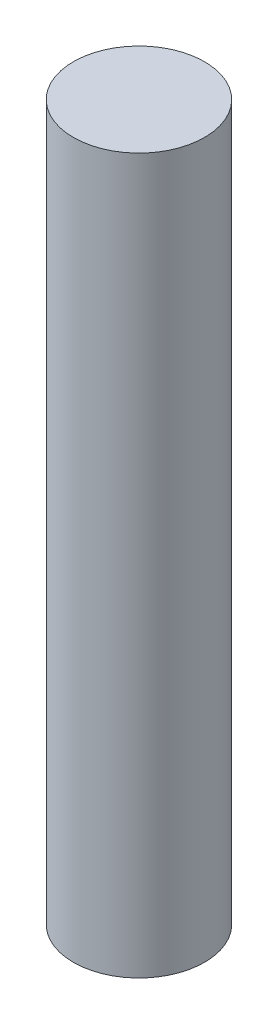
from build123d import *

# Parameters (mm, degrees)
SKETCH1_R           = 2.25
BOSS_EXTRUDE1_DEPTH = 24.5


with BuildPart() as part:
    # Sketch1 → Boss-Extrude1 (new body)
    with BuildSketch(Plane(origin=(0, 0, 0), x_dir=(1, 0, 0), z_dir=(0, 1, 0))):
        with Locations(Location((0, 0, 0), (0, 0, 270))):
            Circle(SKETCH1_R)
    extrude(amount=BOSS_EXTRUDE1_DEPTH)


solid = part.part
